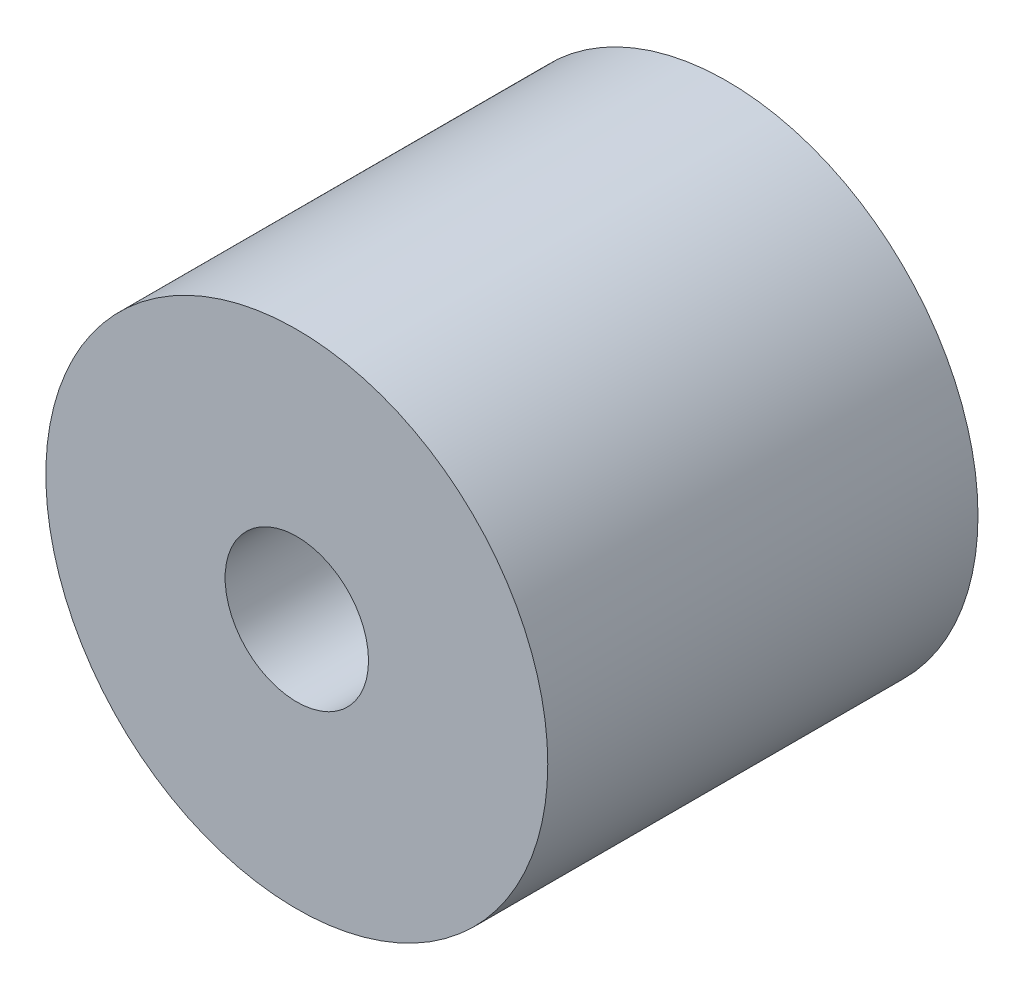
from build123d import *

# Parameters (mm, degrees)
ESQUISSE1_R      = 17.5
ESQUISSE1_R_2    = 5
EXTRUSION1_DEPTH = 30


with BuildPart() as part:
    # Esquisse1 → Extrusion1 (new body)
    with BuildSketch(Plane.XY):
        Circle(ESQUISSE1_R)
        Circle(ESQUISSE1_R_2, mode=Mode.SUBTRACT)
    extrude(amount=EXTRUSION1_DEPTH)


solid = part.part
